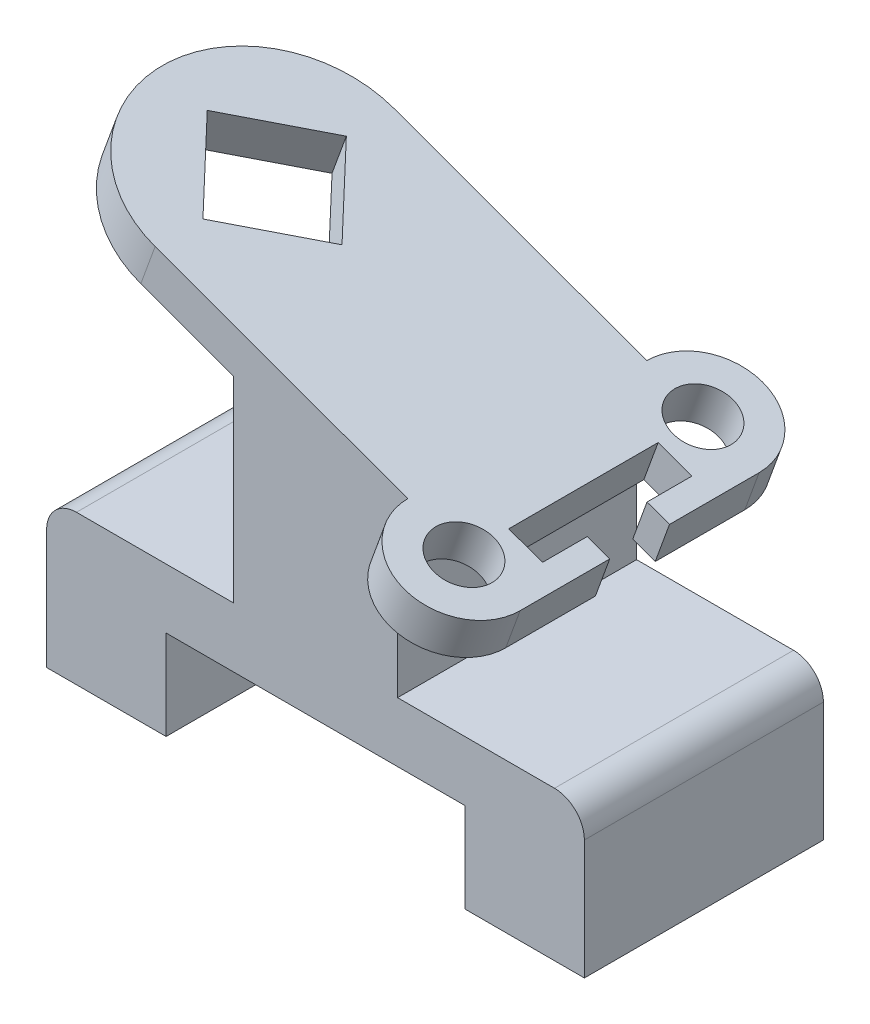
from build123d import *

# Parameters (mm, degrees)
EXTRUDE1_DEPTH                 = 20
EXTRUDE2_DEPTH                 = 5
EXTRUDE2_DEPTH_BACK            = 2
F_10_0_10_DIAMETER_HOLE1_D     = 10
F_10_0_10_DIAMETER_HOLE1_DEPTH = 7
CUT_EXTRUDE1_REACH             = 93.004


with BuildPart() as part:
    # Sketch1 → Extrude1 (new, symmetric)
    with BuildSketch(Plane.XY):
        with BuildLine():
            Line((25, 15), (-25, 15))
            Line((-25, 15), (-25, 0))
            Line((-25, 0), (-45, 0))
            Line((-45, 0), (-45, 20))
            ThreePointArc((-45, 20), (-43.535533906, 23.535533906), (-40, 25))
            Line((-40, 25), (-13.737387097, 25))
            Line((-13.737387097, 25), (-13.737387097, 60))
            Line((-13.737387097, 60), (13.737387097, 50))
            Line((13.737387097, 50), (13.737387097, 25))
            Line((13.737387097, 25), (40, 25))
            ThreePointArc((40, 25), (43.535533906, 23.535533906), (45, 20))
            Line((45, 20), (45, 0))
            Line((45, 0), (25, 0))
            Line((25, 0), (25, 15))
        make_face()
    extrude(amount=EXTRUDE1_DEPTH, both=True)

    # Sketch2 → Extrude2 (add, two sides: drawn at the far end of the back side and taken through both)
    with BuildSketch(Plane(origin=(17.676659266, 48.566222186, 0), x_dir=(-0.939692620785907, 0.34202014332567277, 0), z_dir=(0.34202014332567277, 0.939692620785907, 0)).offset(-EXTRUDE2_DEPTH_BACK)):
        with BuildLine():
            Line((-15.807914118, 5), (-11.807914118, 5))
            Line((-11.807914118, 5), (-11.807914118, 12.5))
            Line((-11.807914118, 12.5), (-5.807914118, 12.5))
            Line((-5.807914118, 12.5), (-5.807914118, -12.5))
            Line((-5.807914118, -12.5), (-11.807914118, -12.5))
            Line((-11.807914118, -12.5), (-11.807914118, -5))
            Line((-11.807914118, -5), (-15.807914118, -5))
            Line((-15.807914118, -5), (-15.807914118, -20))
            ThreePointArc((-15.807914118, -20), (-5.807914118, -30), (4.192085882, -20))
            Line((4.192085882, -20), (49.192085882, -20))
            ThreePointArc((49.192085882, -20), (69.192085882, 0), (49.192085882, 20))
            Line((49.192085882, 20), (4.192085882, 20))
            ThreePointArc((4.192085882, 20), (-5.807914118, 30), (-15.807914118, 20))
            Line((-15.807914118, 20), (-15.807914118, 5))
        make_face()
    extrude(amount=EXTRUDE2_DEPTH + EXTRUDE2_DEPTH_BACK)

    # 10.0 _10_ Diameter Hole1
    with Locations(Plane(origin=(19.386759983, 53.26468529, 0), x_dir=(-0.939692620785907, 0.34202014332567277, 0), z_dir=(0.34202014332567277, 0.939692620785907, 0))):
        with Locations((-5.807914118, -20), (-5.807914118, 20)):
            Hole(F_10_0_10_DIAMETER_HOLE1_D / 2, depth=F_10_0_10_DIAMETER_HOLE1_DEPTH)

    # Sketch7 → Cut-Extrude1 (cut, up to next)
    with BuildSketch(Plane(origin=(19.386759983, 53.26468529, 0), x_dir=(-0.939692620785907, 0.34202014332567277, 0), z_dir=(0.34202014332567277, 0.939692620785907, 0)), mode=Mode.PRIVATE) as cut_extrude1_sk1:
        Polygon((61.192085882, 0), (49.192085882, 12), (37.192085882, 0), (49.192085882, -12), align=None)
    cut_extrude1_tool1 = extrude(cut_extrude1_sk1.sketch, amount=-CUT_EXTRUDE1_REACH, mode=Mode.PRIVATE) & part.part
    add(cut_extrude1_tool1.solids().sort_by_distance((-26.83868, 70.08937, 0))[0], mode=Mode.SUBTRACT)


solid = part.part
